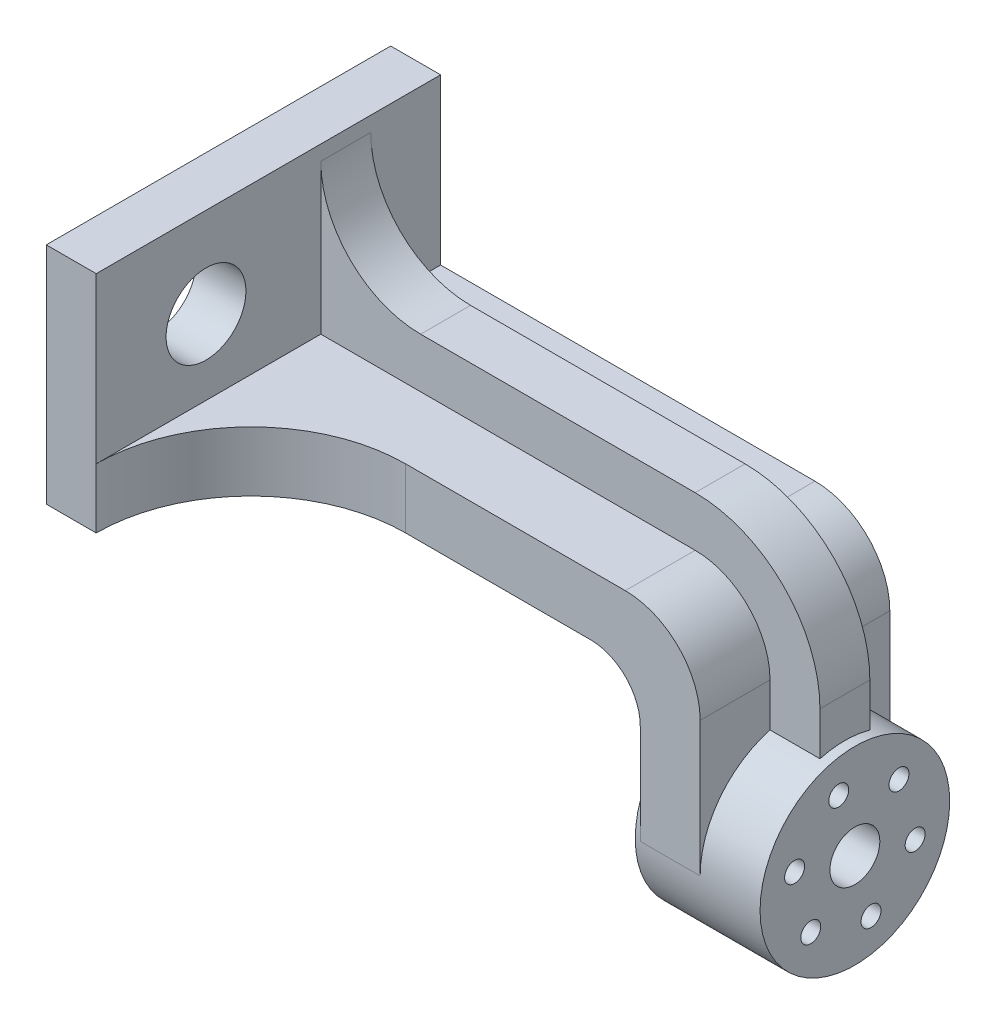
ISO-10303-21;
HEADER;
FILE_DESCRIPTION(('STEP AP214'),'2;1');
FILE_NAME('part.step','',(''),(''),'','','');
FILE_SCHEMA(('AUTOMOTIVE_DESIGN { 1 0 10303 214 1 1 1 1 }'));
ENDSEC;
DATA;
#1=APPLICATION_CONTEXT('core data for automotive mechanical design processes');
#2=APPLICATION_PROTOCOL_DEFINITION('international standard','automotive_design',2000,#1);
#3=PRODUCT_CONTEXT('',#1,'mechanical');
#4=PRODUCT('Part','Part','',(#3));
#5=PRODUCT_RELATED_PRODUCT_CATEGORY('part','',(#4));
#6=PRODUCT_DEFINITION_FORMATION('','',#4);
#7=PRODUCT_DEFINITION_CONTEXT('part definition',#1,'design');
#8=PRODUCT_DEFINITION('design','',#6,#7);
#9=PRODUCT_DEFINITION_SHAPE('','',#8);
#10=(LENGTH_UNIT() NAMED_UNIT(*) SI_UNIT(.MILLI.,.METRE.));
#11=(NAMED_UNIT(*) PLANE_ANGLE_UNIT() SI_UNIT($,.RADIAN.));
#12=(NAMED_UNIT(*) SI_UNIT($,.STERADIAN.) SOLID_ANGLE_UNIT());
#13=UNCERTAINTY_MEASURE_WITH_UNIT(LENGTH_MEASURE(1.E-05),#10,'distance_accuracy_value','');
#14=(GEOMETRIC_REPRESENTATION_CONTEXT(3) GLOBAL_UNCERTAINTY_ASSIGNED_CONTEXT((#13)) GLOBAL_UNIT_ASSIGNED_CONTEXT((#10,
#11,#12)) REPRESENTATION_CONTEXT('',''));
#15=CARTESIAN_POINT('',(0.,0.,0.));
#16=DIRECTION('',(0.,0.,1.));
#17=DIRECTION('',(1.,0.,0.));
#18=AXIS2_PLACEMENT_3D('',#15,#16,#17);
#19=CARTESIAN_POINT('',(100.,-30.,-31.));
#20=DIRECTION('',(1.,0.,0.));
#21=DIRECTION('',(0.,0.,-1.));
#22=AXIS2_PLACEMENT_3D('',#19,#20,#21);
#23=PLANE('',#22);
#24=CARTESIAN_POINT('',(100.,-30.,-50.));
#25=DIRECTION('',(1.,0.,0.));
#26=DIRECTION('',(0.,0.,-1.));
#27=AXIS2_PLACEMENT_3D('',#24,#25,#26);
#28=CIRCLE('',#27,19.);
#29=CARTESIAN_POINT('',(100.,-11.6696972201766,-45.));
#30=VERTEX_POINT('',#29);
#31=CARTESIAN_POINT('',(100.,-30.,-31.));
#32=VERTEX_POINT('',#31);
#33=EDGE_CURVE('E284',#30,#32,#28,.T.);
#34=ORIENTED_EDGE('',*,*,#33,.F.);
#35=DIRECTION('',(0.,1.,0.));
#36=VECTOR('',#35,1.);
#37=CARTESIAN_POINT('',(100.,-30.,-45.));
#38=LINE('',#37,#36);
#39=CARTESIAN_POINT('',(100.,-3.00000000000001,-45.));
#40=VERTEX_POINT('',#39);
#41=EDGE_CURVE('E215',#30,#40,#38,.T.);
#42=ORIENTED_EDGE('',*,*,#41,.T.);
#43=DIRECTION('',(0.,0.,-1.));
#44=VECTOR('',#43,1.);
#45=CARTESIAN_POINT('',(100.,-3.00000000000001,-31.));
#46=LINE('',#45,#44);
#47=CARTESIAN_POINT('',(100.,-3.00000000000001,-31.));
#48=VERTEX_POINT('',#47);
#49=EDGE_CURVE('E352',#40,#48,#46,.F.);
#50=ORIENTED_EDGE('',*,*,#49,.T.);
#51=DIRECTION('',(0.,-1.,0.));
#52=VECTOR('',#51,1.);
#53=CARTESIAN_POINT('',(100.,-30.,-31.));
#54=LINE('',#53,#52);
#55=EDGE_CURVE('E294',#48,#32,#54,.T.);
#56=ORIENTED_EDGE('',*,*,#55,.T.);
#57=EDGE_LOOP('',(#34,#42,#50,#56));
#58=FACE_BOUND('',#57,.T.);
#59=ADVANCED_FACE('F33',(#58),#23,.T.);
#60=CARTESIAN_POINT('',(100.,12.,-31.));
#61=DIRECTION('',(0.,1.,0.));
#62=DIRECTION('',(0.,0.,1.));
#63=AXIS2_PLACEMENT_3D('',#60,#61,#62);
#64=PLANE('',#63);
#65=DIRECTION('',(0.,0.,-1.));
#66=VECTOR('',#65,1.);
#67=CARTESIAN_POINT('',(85.,12.,-31.));
#68=LINE('',#67,#66);
#69=CARTESIAN_POINT('',(85.,12.,-31.));
#70=VERTEX_POINT('',#69);
#71=CARTESIAN_POINT('',(85.,12.,-45.));
#72=VERTEX_POINT('',#71);
#73=EDGE_CURVE('E355',#70,#72,#68,.T.);
#74=ORIENTED_EDGE('',*,*,#73,.T.);
#75=DIRECTION('',(-1.,0.,0.));
#76=VECTOR('',#75,1.);
#77=CARTESIAN_POINT('',(100.,12.,-45.));
#78=LINE('',#77,#76);
#79=CARTESIAN_POINT('',(10.,12.,-45.));
#80=VERTEX_POINT('',#79);
#81=EDGE_CURVE('E212',#72,#80,#78,.T.);
#82=ORIENTED_EDGE('',*,*,#81,.T.);
#83=DIRECTION('',(0.,0.,-1.));
#84=VECTOR('',#83,1.);
#85=CARTESIAN_POINT('',(10.,12.,-31.));
#86=LINE('',#85,#84);
#87=CARTESIAN_POINT('',(10.,12.,0.));
#88=VERTEX_POINT('',#87);
#89=EDGE_CURVE('E318',#88,#80,#86,.T.);
#90=ORIENTED_EDGE('',*,*,#89,.F.);
#91=CARTESIAN_POINT('',(41.,12.,0.));
#92=DIRECTION('',(0.,1.,0.));
#93=DIRECTION('',(0.,0.,1.));
#94=AXIS2_PLACEMENT_3D('',#91,#92,#93);
#95=CIRCLE('',#94,31.);
#96=CARTESIAN_POINT('',(41.,12.,-31.));
#97=VERTEX_POINT('',#96);
#98=EDGE_CURVE('E341',#88,#97,#95,.F.);
#99=ORIENTED_EDGE('',*,*,#98,.T.);
#100=DIRECTION('',(1.,0.,0.));
#101=VECTOR('',#100,1.);
#102=CARTESIAN_POINT('',(100.,12.,-31.));
#103=LINE('',#102,#101);
#104=EDGE_CURVE('E291',#97,#70,#103,.T.);
#105=ORIENTED_EDGE('',*,*,#104,.T.);
#106=EDGE_LOOP('',(#74,#82,#90,#99,#105));
#107=FACE_BOUND('',#106,.T.);
#108=ADVANCED_FACE('F461',(#107),#64,.T.);
#109=CARTESIAN_POINT('',(85.,-3.00000000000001,-31.));
#110=DIRECTION('',(0.,0.,-1.));
#111=DIRECTION('',(-1.,0.,0.));
#112=AXIS2_PLACEMENT_3D('',#109,#110,#111);
#113=CYLINDRICAL_SURFACE('',#112,15.);
#114=ORIENTED_EDGE('',*,*,#49,.F.);
#115=CARTESIAN_POINT('',(85.,-3.00000000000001,-45.));
#116=DIRECTION('',(0.,0.,-1.));
#117=DIRECTION('',(-1.,0.,0.));
#118=AXIS2_PLACEMENT_3D('',#115,#116,#117);
#119=CIRCLE('',#118,15.);
#120=EDGE_CURVE('E204',#40,#72,#119,.F.);
#121=ORIENTED_EDGE('',*,*,#120,.T.);
#122=ORIENTED_EDGE('',*,*,#73,.F.);
#123=CARTESIAN_POINT('',(85.,-3.00000000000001,-31.));
#124=DIRECTION('',(0.,0.,1.));
#125=DIRECTION('',(1.,0.,0.));
#126=AXIS2_PLACEMENT_3D('',#123,#124,#125);
#127=CIRCLE('',#126,15.);
#128=EDGE_CURVE('E361',#48,#70,#127,.T.);
#129=ORIENTED_EDGE('',*,*,#128,.F.);
#130=EDGE_LOOP('',(#114,#121,#122,#129));
#131=FACE_BOUND('',#130,.T.);
#132=ADVANCED_FACE('F459',(#131),#113,.T.);
#133=CARTESIAN_POINT('',(10.,0.,0.));
#134=DIRECTION('',(0.,0.,-1.));
#135=DIRECTION('',(-1.,0.,0.));
#136=AXIS2_PLACEMENT_3D('',#133,#134,#135);
#137=PLANE('',#136);
#138=DIRECTION('',(0.,-1.,0.));
#139=VECTOR('',#138,1.);
#140=CARTESIAN_POINT('',(0.,0.,0.));
#141=LINE('',#140,#139);
#142=CARTESIAN_POINT('',(0.,45.,0.));
#143=VERTEX_POINT('',#142);
#144=CARTESIAN_POINT('',(0.,0.,0.));
#145=VERTEX_POINT('',#144);
#146=EDGE_CURVE('E407',#143,#145,#141,.T.);
#147=ORIENTED_EDGE('',*,*,#146,.T.);
#148=DIRECTION('',(-1.,0.,0.));
#149=VECTOR('',#148,1.);
#150=CARTESIAN_POINT('',(10.,0.,0.));
#151=LINE('',#150,#149);
#152=CARTESIAN_POINT('',(10.,0.,0.));
#153=VERTEX_POINT('',#152);
#154=EDGE_CURVE('E363',#153,#145,#151,.T.);
#155=ORIENTED_EDGE('',*,*,#154,.F.);
#156=DIRECTION('',(0.,-1.,0.));
#157=VECTOR('',#156,1.);
#158=CARTESIAN_POINT('',(10.,0.,0.));
#159=LINE('',#158,#157);
#160=EDGE_CURVE('E378',#88,#153,#159,.T.);
#161=ORIENTED_EDGE('',*,*,#160,.F.);
#162=CARTESIAN_POINT('',(10.,45.,0.));
#163=VERTEX_POINT('',#162);
#164=EDGE_CURVE('E314',#163,#88,#159,.T.);
#165=ORIENTED_EDGE('',*,*,#164,.F.);
#166=DIRECTION('',(-1.,0.,0.));
#167=VECTOR('',#166,1.);
#168=CARTESIAN_POINT('',(10.,45.,0.));
#169=LINE('',#168,#167);
#170=EDGE_CURVE('E395',#163,#143,#169,.T.);
#171=ORIENTED_EDGE('',*,*,#170,.T.);
#172=EDGE_LOOP('',(#147,#155,#161,#165,#171));
#173=FACE_BOUND('',#172,.T.);
#174=ADVANCED_FACE('F417',(#173),#137,.F.);
#175=CARTESIAN_POINT('',(10.,0.,0.));
#176=DIRECTION('',(0.,1.,0.));
#177=DIRECTION('',(0.,0.,1.));
#178=AXIS2_PLACEMENT_3D('',#175,#176,#177);
#179=PLANE('',#178);
#180=DIRECTION('',(0.,0.,-1.));
#181=VECTOR('',#180,1.);
#182=CARTESIAN_POINT('',(78.,0.,0.));
#183=LINE('',#182,#181);
#184=CARTESIAN_POINT('',(78.,0.,-69.));
#185=VERTEX_POINT('',#184);
#186=CARTESIAN_POINT('',(78.,0.,-31.));
#187=VERTEX_POINT('',#186);
#188=EDGE_CURVE('E345',#185,#187,#183,.F.);
#189=ORIENTED_EDGE('',*,*,#188,.T.);
#190=DIRECTION('',(-1.,0.,0.));
#191=VECTOR('',#190,1.);
#192=CARTESIAN_POINT('',(10.,0.,-31.));
#193=LINE('',#192,#191);
#194=CARTESIAN_POINT('',(41.,0.,-31.));
#195=VERTEX_POINT('',#194);
#196=EDGE_CURVE('E304',#187,#195,#193,.T.);
#197=ORIENTED_EDGE('',*,*,#196,.T.);
#198=CARTESIAN_POINT('',(41.,0.,0.));
#199=DIRECTION('',(0.,1.,0.));
#200=DIRECTION('',(0.,0.,1.));
#201=AXIS2_PLACEMENT_3D('',#198,#199,#200);
#202=CIRCLE('',#201,31.);
#203=EDGE_CURVE('E336',#195,#153,#202,.T.);
#204=ORIENTED_EDGE('',*,*,#203,.T.);
#205=ORIENTED_EDGE('',*,*,#154,.T.);
#206=DIRECTION('',(0.,0.,-1.));
#207=VECTOR('',#206,1.);
#208=CARTESIAN_POINT('',(0.,0.,0.));
#209=LINE('',#208,#207);
#210=CARTESIAN_POINT('',(0.,0.,-69.));
#211=VERTEX_POINT('',#210);
#212=EDGE_CURVE('E391',#145,#211,#209,.T.);
#213=ORIENTED_EDGE('',*,*,#212,.T.);
#214=DIRECTION('',(-1.,0.,0.));
#215=VECTOR('',#214,1.);
#216=CARTESIAN_POINT('',(10.,0.,-69.));
#217=LINE('',#216,#215);
#218=EDGE_CURVE('E400',#185,#211,#217,.T.);
#219=ORIENTED_EDGE('',*,*,#218,.F.);
#220=EDGE_LOOP('',(#189,#197,#204,#205,#213,#219));
#221=FACE_BOUND('',#220,.T.);
#222=ADVANCED_FACE('F368',(#221),#179,.F.);
#223=CARTESIAN_POINT('',(10.,0.,-69.));
#224=DIRECTION('',(0.,0.,1.));
#225=DIRECTION('',(1.,0.,0.));
#226=AXIS2_PLACEMENT_3D('',#223,#224,#225);
#227=PLANE('',#226);
#228=DIRECTION('',(1.,0.,0.));
#229=VECTOR('',#228,1.);
#230=CARTESIAN_POINT('',(100.,12.,-69.));
#231=LINE('',#230,#229);
#232=CARTESIAN_POINT('',(10.,12.,-69.));
#233=VERTEX_POINT('',#232);
#234=CARTESIAN_POINT('',(85.,12.,-69.));
#235=VERTEX_POINT('',#234);
#236=EDGE_CURVE('E290',#233,#235,#231,.T.);
#237=ORIENTED_EDGE('',*,*,#236,.T.);
#238=CARTESIAN_POINT('',(85.,-3.00000000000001,-69.));
#239=DIRECTION('',(0.,0.,1.));
#240=DIRECTION('',(1.,0.,0.));
#241=AXIS2_PLACEMENT_3D('',#238,#239,#240);
#242=CIRCLE('',#241,15.);
#243=CARTESIAN_POINT('',(100.,-3.00000000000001,-69.));
#244=VERTEX_POINT('',#243);
#245=EDGE_CURVE('E353',#235,#244,#242,.F.);
#246=ORIENTED_EDGE('',*,*,#245,.T.);
#247=DIRECTION('',(0.,-1.,0.));
#248=VECTOR('',#247,1.);
#249=CARTESIAN_POINT('',(100.,-30.,-69.));
#250=LINE('',#249,#248);
#251=CARTESIAN_POINT('',(100.,-30.,-69.));
#252=VERTEX_POINT('',#251);
#253=EDGE_CURVE('E305',#244,#252,#250,.T.);
#254=ORIENTED_EDGE('',*,*,#253,.T.);
#255=DIRECTION('',(-1.,0.,0.));
#256=VECTOR('',#255,1.);
#257=CARTESIAN_POINT('',(88.,-30.,-69.));
#258=LINE('',#257,#256);
#259=CARTESIAN_POINT('',(88.,-30.,-69.));
#260=VERTEX_POINT('',#259);
#261=EDGE_CURVE('E307',#252,#260,#258,.T.);
#262=ORIENTED_EDGE('',*,*,#261,.T.);
#263=DIRECTION('',(0.,1.,0.));
#264=VECTOR('',#263,1.);
#265=CARTESIAN_POINT('',(88.,0.,-69.));
#266=LINE('',#265,#264);
#267=CARTESIAN_POINT('',(88.,-10.,-69.));
#268=VERTEX_POINT('',#267);
#269=EDGE_CURVE('E295',#260,#268,#266,.T.);
#270=ORIENTED_EDGE('',*,*,#269,.T.);
#271=CARTESIAN_POINT('',(78.,-10.,-69.));
#272=DIRECTION('',(0.,0.,1.));
#273=DIRECTION('',(1.,0.,0.));
#274=AXIS2_PLACEMENT_3D('',#271,#272,#273);
#275=CIRCLE('',#274,10.);
#276=EDGE_CURVE('E332',#268,#185,#275,.T.);
#277=ORIENTED_EDGE('',*,*,#276,.T.);
#278=ORIENTED_EDGE('',*,*,#218,.T.);
#279=DIRECTION('',(0.,1.,0.));
#280=VECTOR('',#279,1.);
#281=CARTESIAN_POINT('',(0.,0.,-69.));
#282=LINE('',#281,#280);
#283=CARTESIAN_POINT('',(0.,45.,-69.));
#284=VERTEX_POINT('',#283);
#285=EDGE_CURVE('E384',#211,#284,#282,.T.);
#286=ORIENTED_EDGE('',*,*,#285,.T.);
#287=DIRECTION('',(-1.,0.,0.));
#288=VECTOR('',#287,1.);
#289=CARTESIAN_POINT('',(10.,45.,-69.));
#290=LINE('',#289,#288);
#291=CARTESIAN_POINT('',(10.,45.,-69.));
#292=VERTEX_POINT('',#291);
#293=EDGE_CURVE('E397',#292,#284,#290,.T.);
#294=ORIENTED_EDGE('',*,*,#293,.F.);
#295=DIRECTION('',(0.,1.,0.));
#296=VECTOR('',#295,1.);
#297=CARTESIAN_POINT('',(10.,0.,-69.));
#298=LINE('',#297,#296);
#299=EDGE_CURVE('E383',#233,#292,#298,.T.);
#300=ORIENTED_EDGE('',*,*,#299,.F.);
#301=EDGE_LOOP('',(#237,#246,#254,#262,#270,#277,#278,#286,#294,#300));
#302=FACE_BOUND('',#301,.T.);
#303=ADVANCED_FACE('F413',(#302),#227,.F.);
#304=CARTESIAN_POINT('',(10.,45.,0.));
#305=DIRECTION('',(0.,-1.,0.));
#306=DIRECTION('',(0.,0.,-1.));
#307=AXIS2_PLACEMENT_3D('',#304,#305,#306);
#308=PLANE('',#307);
#309=DIRECTION('',(0.,0.,1.));
#310=VECTOR('',#309,1.);
#311=CARTESIAN_POINT('',(0.,45.,0.));
#312=LINE('',#311,#310);
#313=EDGE_CURVE('E382',#284,#143,#312,.T.);
#314=ORIENTED_EDGE('',*,*,#313,.T.);
#315=ORIENTED_EDGE('',*,*,#170,.F.);
#316=DIRECTION('',(0.,0.,1.));
#317=VECTOR('',#316,1.);
#318=CARTESIAN_POINT('',(10.,45.,0.));
#319=LINE('',#318,#317);
#320=EDGE_CURVE('E398',#292,#163,#319,.T.);
#321=ORIENTED_EDGE('',*,*,#320,.F.);
#322=ORIENTED_EDGE('',*,*,#293,.T.);
#323=EDGE_LOOP('',(#314,#315,#321,#322));
#324=FACE_BOUND('',#323,.T.);
#325=ADVANCED_FACE('F419',(#324),#308,.F.);
#326=CARTESIAN_POINT('',(10.,45.,0.));
#327=DIRECTION('',(-1.,0.,0.));
#328=DIRECTION('',(0.,0.,1.));
#329=AXIS2_PLACEMENT_3D('',#326,#327,#328);
#330=PLANE('',#329);
#331=CARTESIAN_POINT('',(10.,27.,-22.));
#332=DIRECTION('',(1.,0.,0.));
#333=DIRECTION('',(0.,0.,-1.));
#334=AXIS2_PLACEMENT_3D('',#331,#332,#333);
#335=CIRCLE('',#334,8.);
#336=CARTESIAN_POINT('',(10.,27.,-30.));
#337=VERTEX_POINT('',#336);
#338=EDGE_CURVE('E231',#337,#337,#335,.T.);
#339=ORIENTED_EDGE('',*,*,#338,.F.);
#340=EDGE_LOOP('',(#339));
#341=FACE_BOUND('',#340,.T.);
#342=DIRECTION('',(0.,0.,-1.));
#343=VECTOR('',#342,1.);
#344=CARTESIAN_POINT('',(10.,42.,0.));
#345=LINE('',#344,#343);
#346=CARTESIAN_POINT('',(10.,42.,-45.));
#347=VERTEX_POINT('',#346);
#348=CARTESIAN_POINT('',(10.,42.,-55.));
#349=VERTEX_POINT('',#348);
#350=EDGE_CURVE('E327',#347,#349,#345,.T.);
#351=ORIENTED_EDGE('',*,*,#350,.T.);
#352=DIRECTION('',(0.,-1.,0.));
#353=VECTOR('',#352,1.);
#354=CARTESIAN_POINT('',(10.,45.,-55.));
#355=LINE('',#354,#353);
#356=CARTESIAN_POINT('',(10.,12.,-55.));
#357=VERTEX_POINT('',#356);
#358=EDGE_CURVE('E221',#349,#357,#355,.T.);
#359=ORIENTED_EDGE('',*,*,#358,.T.);
#360=EDGE_CURVE('E322',#357,#233,#86,.T.);
#361=ORIENTED_EDGE('',*,*,#360,.T.);
#362=ORIENTED_EDGE('',*,*,#299,.T.);
#363=ORIENTED_EDGE('',*,*,#320,.T.);
#364=ORIENTED_EDGE('',*,*,#164,.T.);
#365=ORIENTED_EDGE('',*,*,#89,.T.);
#366=DIRECTION('',(0.,-1.,0.));
#367=VECTOR('',#366,1.);
#368=CARTESIAN_POINT('',(10.,45.,-45.));
#369=LINE('',#368,#367);
#370=EDGE_CURVE('E209',#347,#80,#369,.T.);
#371=ORIENTED_EDGE('',*,*,#370,.F.);
#372=EDGE_LOOP('',(#351,#359,#361,#362,#363,#364,#365,#371));
#373=FACE_BOUND('',#372,.T.);
#374=ADVANCED_FACE('F420',(#341,#373),#330,.F.);
#375=CARTESIAN_POINT('',(0.,45.,0.));
#376=DIRECTION('',(-1.,0.,0.));
#377=DIRECTION('',(0.,0.,1.));
#378=AXIS2_PLACEMENT_3D('',#375,#376,#377);
#379=PLANE('',#378);
#380=ORIENTED_EDGE('',*,*,#285,.F.);
#381=ORIENTED_EDGE('',*,*,#212,.F.);
#382=ORIENTED_EDGE('',*,*,#146,.F.);
#383=ORIENTED_EDGE('',*,*,#313,.F.);
#384=EDGE_LOOP('',(#380,#381,#382,#383));
#385=FACE_BOUND('',#384,.T.);
#386=CARTESIAN_POINT('',(0.,27.,-22.));
#387=DIRECTION('',(-1.,0.,0.));
#388=DIRECTION('',(0.,0.,1.));
#389=AXIS2_PLACEMENT_3D('',#386,#387,#388);
#390=CIRCLE('',#389,8.);
#391=CARTESIAN_POINT('',(0.,27.,-14.));
#392=VERTEX_POINT('',#391);
#393=EDGE_CURVE('E230',#392,#392,#390,.F.);
#394=ORIENTED_EDGE('',*,*,#393,.T.);
#395=EDGE_LOOP('',(#394));
#396=FACE_BOUND('',#395,.T.);
#397=ADVANCED_FACE('F415',(#385,#396),#379,.T.);
#398=CARTESIAN_POINT('',(88.,0.,-31.));
#399=DIRECTION('',(-1.,0.,0.));
#400=DIRECTION('',(0.,0.,1.));
#401=AXIS2_PLACEMENT_3D('',#398,#399,#400);
#402=PLANE('',#401);
#403=ORIENTED_EDGE('',*,*,#269,.F.);
#404=CARTESIAN_POINT('',(88.,-30.,-50.));
#405=DIRECTION('',(-1.,0.,0.));
#406=DIRECTION('',(0.,0.,1.));
#407=AXIS2_PLACEMENT_3D('',#404,#405,#406);
#408=CIRCLE('',#407,19.);
#409=CARTESIAN_POINT('',(88.,-30.,-31.));
#410=VERTEX_POINT('',#409);
#411=EDGE_CURVE('E288',#410,#260,#408,.T.);
#412=ORIENTED_EDGE('',*,*,#411,.F.);
#413=DIRECTION('',(0.,1.,0.));
#414=VECTOR('',#413,1.);
#415=CARTESIAN_POINT('',(88.,0.,-31.));
#416=LINE('',#415,#414);
#417=CARTESIAN_POINT('',(88.,-10.,-31.));
#418=VERTEX_POINT('',#417);
#419=EDGE_CURVE('E301',#410,#418,#416,.T.);
#420=ORIENTED_EDGE('',*,*,#419,.T.);
#421=DIRECTION('',(0.,0.,-1.));
#422=VECTOR('',#421,1.);
#423=CARTESIAN_POINT('',(88.,-10.,-31.));
#424=LINE('',#423,#422);
#425=EDGE_CURVE('E347',#418,#268,#424,.T.);
#426=ORIENTED_EDGE('',*,*,#425,.T.);
#427=EDGE_LOOP('',(#403,#412,#420,#426));
#428=FACE_BOUND('',#427,.T.);
#429=ADVANCED_FACE('F447',(#428),#402,.T.);
#430=DIRECTION('',(0.,1.,0.));
#431=VECTOR('',#430,1.);
#432=CARTESIAN_POINT('',(100.,-30.,-55.));
#433=LINE('',#432,#431);
#434=CARTESIAN_POINT('',(100.,-11.6696972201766,-55.));
#435=VERTEX_POINT('',#434);
#436=CARTESIAN_POINT('',(100.,-3.00000000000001,-55.));
#437=VERTEX_POINT('',#436);
#438=EDGE_CURVE('E225',#435,#437,#433,.T.);
#439=ORIENTED_EDGE('',*,*,#438,.F.);
#440=EDGE_CURVE('E285',#252,#435,#28,.T.);
#441=ORIENTED_EDGE('',*,*,#440,.F.);
#442=ORIENTED_EDGE('',*,*,#253,.F.);
#443=EDGE_CURVE('E349',#244,#437,#46,.F.);
#444=ORIENTED_EDGE('',*,*,#443,.T.);
#445=EDGE_LOOP('',(#439,#441,#442,#444));
#446=FACE_BOUND('',#445,.T.);
#447=ADVANCED_FACE('F437',(#446),#23,.T.);
#448=DIRECTION('',(-1.,0.,0.));
#449=VECTOR('',#448,1.);
#450=CARTESIAN_POINT('',(100.,12.,-55.));
#451=LINE('',#450,#449);
#452=CARTESIAN_POINT('',(85.,12.,-55.));
#453=VERTEX_POINT('',#452);
#454=EDGE_CURVE('E223',#453,#357,#451,.T.);
#455=ORIENTED_EDGE('',*,*,#454,.F.);
#456=EDGE_CURVE('E358',#453,#235,#68,.T.);
#457=ORIENTED_EDGE('',*,*,#456,.T.);
#458=ORIENTED_EDGE('',*,*,#236,.F.);
#459=ORIENTED_EDGE('',*,*,#360,.F.);
#460=EDGE_LOOP('',(#455,#457,#458,#459));
#461=FACE_BOUND('',#460,.T.);
#462=ADVANCED_FACE('F429',(#461),#64,.T.);
#463=CARTESIAN_POINT('',(10.,0.,-31.));
#464=DIRECTION('',(0.,0.,1.));
#465=DIRECTION('',(1.,0.,0.));
#466=AXIS2_PLACEMENT_3D('',#463,#464,#465);
#467=PLANE('',#466);
#468=ORIENTED_EDGE('',*,*,#104,.F.);
#469=DIRECTION('',(0.,1.,0.));
#470=VECTOR('',#469,1.);
#471=CARTESIAN_POINT('',(41.,0.,-31.));
#472=LINE('',#471,#470);
#473=EDGE_CURVE('E359',#97,#195,#472,.F.);
#474=ORIENTED_EDGE('',*,*,#473,.T.);
#475=ORIENTED_EDGE('',*,*,#196,.F.);
#476=CARTESIAN_POINT('',(78.,-10.,-31.));
#477=DIRECTION('',(0.,0.,1.));
#478=DIRECTION('',(1.,0.,0.));
#479=AXIS2_PLACEMENT_3D('',#476,#477,#478);
#480=CIRCLE('',#479,10.);
#481=EDGE_CURVE('E325',#187,#418,#480,.F.);
#482=ORIENTED_EDGE('',*,*,#481,.T.);
#483=ORIENTED_EDGE('',*,*,#419,.F.);
#484=DIRECTION('',(-1.,0.,0.));
#485=VECTOR('',#484,1.);
#486=CARTESIAN_POINT('',(88.,-30.,-31.));
#487=LINE('',#486,#485);
#488=EDGE_CURVE('E298',#32,#410,#487,.T.);
#489=ORIENTED_EDGE('',*,*,#488,.F.);
#490=ORIENTED_EDGE('',*,*,#55,.F.);
#491=ORIENTED_EDGE('',*,*,#128,.T.);
#492=EDGE_LOOP('',(#468,#474,#475,#482,#483,#489,#490,#491));
#493=FACE_BOUND('',#492,.T.);
#494=ADVANCED_FACE('F476',(#493),#467,.T.);
#495=CARTESIAN_POINT('',(87.,-30.,-50.));
#496=DIRECTION('',(1.,0.,0.));
#497=DIRECTION('',(0.,0.,-1.));
#498=AXIS2_PLACEMENT_3D('',#495,#496,#497);
#499=CYLINDRICAL_SURFACE('',#498,19.);
#500=CARTESIAN_POINT('',(87.,-30.,-50.));
#501=DIRECTION('',(1.,0.,0.));
#502=DIRECTION('',(0.,0.,-1.));
#503=AXIS2_PLACEMENT_3D('',#500,#501,#502);
#504=CIRCLE('',#503,19.);
#505=CARTESIAN_POINT('',(87.,-30.,-69.));
#506=VERTEX_POINT('',#505);
#507=EDGE_CURVE('E281',#506,#506,#504,.T.);
#508=ORIENTED_EDGE('',*,*,#507,.T.);
#509=EDGE_LOOP('',(#508));
#510=FACE_BOUND('',#509,.T.);
#511=ORIENTED_EDGE('',*,*,#411,.T.);
#512=ORIENTED_EDGE('',*,*,#261,.F.);
#513=ORIENTED_EDGE('',*,*,#440,.T.);
#514=DIRECTION('',(1.,0.,0.));
#515=VECTOR('',#514,1.);
#516=CARTESIAN_POINT('',(87.,-11.6696972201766,-55.));
#517=LINE('',#516,#515);
#518=CARTESIAN_POINT('',(110.,-11.6696972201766,-55.));
#519=VERTEX_POINT('',#518);
#520=EDGE_CURVE('E219',#519,#435,#517,.F.);
#521=ORIENTED_EDGE('',*,*,#520,.F.);
#522=CARTESIAN_POINT('',(110.,-30.,-50.));
#523=DIRECTION('',(1.,0.,0.));
#524=DIRECTION('',(0.,0.,-1.));
#525=AXIS2_PLACEMENT_3D('',#522,#523,#524);
#526=CIRCLE('',#525,19.);
#527=CARTESIAN_POINT('',(110.,-11.6696972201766,-45.));
#528=VERTEX_POINT('',#527);
#529=EDGE_CURVE('E194',#528,#519,#526,.F.);
#530=ORIENTED_EDGE('',*,*,#529,.F.);
#531=DIRECTION('',(1.,0.,0.));
#532=VECTOR('',#531,1.);
#533=CARTESIAN_POINT('',(87.,-11.6696972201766,-45.));
#534=LINE('',#533,#532);
#535=EDGE_CURVE('E205',#528,#30,#534,.F.);
#536=ORIENTED_EDGE('',*,*,#535,.T.);
#537=ORIENTED_EDGE('',*,*,#33,.T.);
#538=ORIENTED_EDGE('',*,*,#488,.T.);
#539=EDGE_LOOP('',(#511,#512,#513,#521,#530,#536,#537,#538));
#540=FACE_BOUND('',#539,.T.);
#541=CARTESIAN_POINT('',(112.,-30.,-50.));
#542=DIRECTION('',(1.,0.,0.));
#543=DIRECTION('',(0.,0.,-1.));
#544=AXIS2_PLACEMENT_3D('',#541,#542,#543);
#545=CIRCLE('',#544,19.);
#546=CARTESIAN_POINT('',(112.,-30.,-69.));
#547=VERTEX_POINT('',#546);
#548=EDGE_CURVE('E278',#547,#547,#545,.T.);
#549=ORIENTED_EDGE('',*,*,#548,.F.);
#550=EDGE_LOOP('',(#549));
#551=FACE_BOUND('',#550,.T.);
#552=ADVANCED_FACE('F442',(#510,#540,#551),#499,.T.);
#553=CARTESIAN_POINT('',(87.,-30.,-50.));
#554=DIRECTION('',(1.,0.,0.));
#555=DIRECTION('',(0.,0.,-1.));
#556=AXIS2_PLACEMENT_3D('',#553,#554,#555);
#557=PLANE('',#556);
#558=CARTESIAN_POINT('',(87.,-42.0740728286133,-53.2352380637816));
#559=DIRECTION('',(1.,0.,0.));
#560=DIRECTION('',(0.,0.,-1.));
#561=AXIS2_PLACEMENT_3D('',#558,#559,#560);
#562=CIRCLE('',#561,2.);
#563=CARTESIAN_POINT('',(87.,-42.0740728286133,-55.2352380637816));
#564=VERTEX_POINT('',#563);
#565=EDGE_CURVE('E245',#564,#564,#562,.F.);
#566=ORIENTED_EDGE('',*,*,#565,.F.);
#567=EDGE_LOOP('',(#566));
#568=FACE_BOUND('',#567,.T.);
#569=CARTESIAN_POINT('',(87.,-30.,-50.));
#570=DIRECTION('',(1.,0.,0.));
#571=DIRECTION('',(0.,0.,-1.));
#572=AXIS2_PLACEMENT_3D('',#569,#570,#571);
#573=CIRCLE('',#572,5.);
#574=CARTESIAN_POINT('',(87.,-30.,-55.));
#575=VERTEX_POINT('',#574);
#576=EDGE_CURVE('E275',#575,#575,#573,.F.);
#577=ORIENTED_EDGE('',*,*,#576,.F.);
#578=EDGE_LOOP('',(#577));
#579=FACE_BOUND('',#578,.T.);
#580=CARTESIAN_POINT('',(87.,-33.2352380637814,-62.0740728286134));
#581=DIRECTION('',(1.,0.,0.));
#582=DIRECTION('',(0.,0.,-1.));
#583=AXIS2_PLACEMENT_3D('',#580,#581,#582);
#584=CIRCLE('',#583,2.);
#585=CARTESIAN_POINT('',(87.,-33.2352380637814,-64.0740728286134));
#586=VERTEX_POINT('',#585);
#587=EDGE_CURVE('E239',#586,#586,#584,.F.);
#588=ORIENTED_EDGE('',*,*,#587,.F.);
#589=EDGE_LOOP('',(#588));
#590=FACE_BOUND('',#589,.T.);
#591=ORIENTED_EDGE('',*,*,#507,.F.);
#592=EDGE_LOOP('',(#591));
#593=FACE_BOUND('',#592,.T.);
#594=CARTESIAN_POINT('',(87.,-21.1611652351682,-58.8388347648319));
#595=DIRECTION('',(1.,0.,0.));
#596=DIRECTION('',(0.,0.,-1.));
#597=AXIS2_PLACEMENT_3D('',#594,#595,#596);
#598=CIRCLE('',#597,2.);
#599=CARTESIAN_POINT('',(87.,-21.1611652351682,-60.8388347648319));
#600=VERTEX_POINT('',#599);
#601=EDGE_CURVE('E269',#600,#600,#598,.F.);
#602=ORIENTED_EDGE('',*,*,#601,.F.);
#603=EDGE_LOOP('',(#602));
#604=FACE_BOUND('',#603,.T.);
#605=CARTESIAN_POINT('',(87.,-17.9259271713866,-46.7647619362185));
#606=DIRECTION('',(1.,0.,0.));
#607=DIRECTION('',(0.,0.,-1.));
#608=AXIS2_PLACEMENT_3D('',#605,#606,#607);
#609=CIRCLE('',#608,2.);
#610=CARTESIAN_POINT('',(87.,-17.9259271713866,-48.7647619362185));
#611=VERTEX_POINT('',#610);
#612=EDGE_CURVE('E263',#611,#611,#609,.F.);
#613=ORIENTED_EDGE('',*,*,#612,.F.);
#614=EDGE_LOOP('',(#613));
#615=FACE_BOUND('',#614,.T.);
#616=CARTESIAN_POINT('',(87.,-26.7647619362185,-37.9259271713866));
#617=DIRECTION('',(1.,0.,0.));
#618=DIRECTION('',(0.,0.,-1.));
#619=AXIS2_PLACEMENT_3D('',#616,#617,#618);
#620=CIRCLE('',#619,2.);
#621=CARTESIAN_POINT('',(87.,-26.7647619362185,-39.9259271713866));
#622=VERTEX_POINT('',#621);
#623=EDGE_CURVE('E257',#622,#622,#620,.F.);
#624=ORIENTED_EDGE('',*,*,#623,.F.);
#625=EDGE_LOOP('',(#624));
#626=FACE_BOUND('',#625,.T.);
#627=CARTESIAN_POINT('',(87.,-38.8388347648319,-41.1611652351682));
#628=DIRECTION('',(1.,0.,0.));
#629=DIRECTION('',(0.,0.,-1.));
#630=AXIS2_PLACEMENT_3D('',#627,#628,#629);
#631=CIRCLE('',#630,2.);
#632=CARTESIAN_POINT('',(87.,-38.8388347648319,-43.1611652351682));
#633=VERTEX_POINT('',#632);
#634=EDGE_CURVE('E251',#633,#633,#631,.F.);
#635=ORIENTED_EDGE('',*,*,#634,.F.);
#636=EDGE_LOOP('',(#635));
#637=FACE_BOUND('',#636,.T.);
#638=ADVANCED_FACE('F486',(#568,#579,#590,#593,#604,#615,#626,#637),#557,.F.);
#639=CARTESIAN_POINT('',(112.,-30.,-50.));
#640=DIRECTION('',(1.,0.,0.));
#641=DIRECTION('',(0.,0.,-1.));
#642=AXIS2_PLACEMENT_3D('',#639,#640,#641);
#643=PLANE('',#642);
#644=CARTESIAN_POINT('',(112.,-33.2352380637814,-62.0740728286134));
#645=DIRECTION('',(1.,0.,0.));
#646=DIRECTION('',(0.,-0.866025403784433,-0.50000000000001));
#647=AXIS2_PLACEMENT_3D('',#644,#645,#646);
#648=CIRCLE('',#647,2.);
#649=CARTESIAN_POINT('',(112.,-34.9672888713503,-63.0740728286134));
#650=VERTEX_POINT('',#649);
#651=EDGE_CURVE('E234',#650,#650,#648,.T.);
#652=ORIENTED_EDGE('',*,*,#651,.F.);
#653=EDGE_LOOP('',(#652));
#654=FACE_BOUND('',#653,.T.);
#655=CARTESIAN_POINT('',(112.,-42.0740728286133,-53.2352380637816));
#656=DIRECTION('',(1.,0.,0.));
#657=DIRECTION('',(0.,-0.866025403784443,0.499999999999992));
#658=AXIS2_PLACEMENT_3D('',#655,#656,#657);
#659=CIRCLE('',#658,2.);
#660=CARTESIAN_POINT('',(112.,-43.8061236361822,-52.2352380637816));
#661=VERTEX_POINT('',#660);
#662=EDGE_CURVE('E242',#661,#661,#659,.T.);
#663=ORIENTED_EDGE('',*,*,#662,.F.);
#664=EDGE_LOOP('',(#663));
#665=FACE_BOUND('',#664,.T.);
#666=CARTESIAN_POINT('',(112.,-38.8388347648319,-41.1611652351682));
#667=DIRECTION('',(1.,0.,0.));
#668=DIRECTION('',(0.,0.,1.));
#669=AXIS2_PLACEMENT_3D('',#666,#667,#668);
#670=CIRCLE('',#669,2.);
#671=CARTESIAN_POINT('',(112.,-38.8388347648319,-39.1611652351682));
#672=VERTEX_POINT('',#671);
#673=EDGE_CURVE('E248',#672,#672,#670,.T.);
#674=ORIENTED_EDGE('',*,*,#673,.F.);
#675=EDGE_LOOP('',(#674));
#676=FACE_BOUND('',#675,.T.);
#677=CARTESIAN_POINT('',(112.,-26.7647619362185,-37.9259271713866));
#678=DIRECTION('',(1.,0.,0.));
#679=DIRECTION('',(0.,0.866025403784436,0.500000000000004));
#680=AXIS2_PLACEMENT_3D('',#677,#678,#679);
#681=CIRCLE('',#680,2.);
#682=CARTESIAN_POINT('',(112.,-25.0327111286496,-36.9259271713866));
#683=VERTEX_POINT('',#682);
#684=EDGE_CURVE('E254',#683,#683,#681,.T.);
#685=ORIENTED_EDGE('',*,*,#684,.F.);
#686=EDGE_LOOP('',(#685));
#687=FACE_BOUND('',#686,.T.);
#688=CARTESIAN_POINT('',(112.,-17.9259271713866,-46.7647619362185));
#689=DIRECTION('',(1.,0.,0.));
#690=DIRECTION('',(0.,0.86602540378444,-0.499999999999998));
#691=AXIS2_PLACEMENT_3D('',#688,#689,#690);
#692=CIRCLE('',#691,2.);
#693=CARTESIAN_POINT('',(112.,-16.1938763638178,-47.7647619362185));
#694=VERTEX_POINT('',#693);
#695=EDGE_CURVE('E260',#694,#694,#692,.T.);
#696=ORIENTED_EDGE('',*,*,#695,.F.);
#697=EDGE_LOOP('',(#696));
#698=FACE_BOUND('',#697,.T.);
#699=CARTESIAN_POINT('',(112.,-21.1611652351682,-58.8388347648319));
#700=DIRECTION('',(1.,0.,0.));
#701=DIRECTION('',(0.,0.,-1.));
#702=AXIS2_PLACEMENT_3D('',#699,#700,#701);
#703=CIRCLE('',#702,2.);
#704=CARTESIAN_POINT('',(112.,-21.1611652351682,-60.8388347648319));
#705=VERTEX_POINT('',#704);
#706=EDGE_CURVE('E266',#705,#705,#703,.T.);
#707=ORIENTED_EDGE('',*,*,#706,.F.);
#708=EDGE_LOOP('',(#707));
#709=FACE_BOUND('',#708,.T.);
#710=CARTESIAN_POINT('',(112.,-30.,-50.));
#711=DIRECTION('',(1.,0.,0.));
#712=DIRECTION('',(0.,0.,-1.));
#713=AXIS2_PLACEMENT_3D('',#710,#711,#712);
#714=CIRCLE('',#713,5.);
#715=CARTESIAN_POINT('',(112.,-30.,-55.));
#716=VERTEX_POINT('',#715);
#717=EDGE_CURVE('E272',#716,#716,#714,.T.);
#718=ORIENTED_EDGE('',*,*,#717,.F.);
#719=EDGE_LOOP('',(#718));
#720=FACE_BOUND('',#719,.T.);
#721=ORIENTED_EDGE('',*,*,#548,.T.);
#722=EDGE_LOOP('',(#721));
#723=FACE_BOUND('',#722,.T.);
#724=ADVANCED_FACE('F490',(#654,#665,#676,#687,#698,#709,#720,#723),#643,.T.);
#725=CARTESIAN_POINT('',(-0.001000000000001,-30.,-50.));
#726=DIRECTION('',(1.,0.,0.));
#727=DIRECTION('',(0.,0.,-1.));
#728=AXIS2_PLACEMENT_3D('',#725,#726,#727);
#729=CYLINDRICAL_SURFACE('',#728,5.);
#730=ORIENTED_EDGE('',*,*,#717,.T.);
#731=EDGE_LOOP('',(#730));
#732=FACE_BOUND('',#731,.T.);
#733=ORIENTED_EDGE('',*,*,#576,.T.);
#734=EDGE_LOOP('',(#733));
#735=FACE_BOUND('',#734,.T.);
#736=ADVANCED_FACE('F494',(#732,#735),#729,.F.);
#737=CARTESIAN_POINT('',(-0.001000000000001,-21.1611652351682,-58.8388347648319));
#738=DIRECTION('',(1.,0.,0.));
#739=DIRECTION('',(0.,0.,-1.));
#740=AXIS2_PLACEMENT_3D('',#737,#738,#739);
#741=CYLINDRICAL_SURFACE('',#740,2.);
#742=ORIENTED_EDGE('',*,*,#706,.T.);
#743=EDGE_LOOP('',(#742));
#744=FACE_BOUND('',#743,.T.);
#745=ORIENTED_EDGE('',*,*,#601,.T.);
#746=EDGE_LOOP('',(#745));
#747=FACE_BOUND('',#746,.T.);
#748=ADVANCED_FACE('F498',(#744,#747),#741,.F.);
#749=CARTESIAN_POINT('',(-0.001000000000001,-17.9259271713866,-46.7647619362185));
#750=DIRECTION('',(1.,0.,0.));
#751=DIRECTION('',(0.,0.,-1.));
#752=AXIS2_PLACEMENT_3D('',#749,#750,#751);
#753=CYLINDRICAL_SURFACE('',#752,2.);
#754=ORIENTED_EDGE('',*,*,#612,.T.);
#755=EDGE_LOOP('',(#754));
#756=FACE_BOUND('',#755,.T.);
#757=ORIENTED_EDGE('',*,*,#695,.T.);
#758=EDGE_LOOP('',(#757));
#759=FACE_BOUND('',#758,.T.);
#760=ADVANCED_FACE('F502',(#756,#759),#753,.F.);
#761=CARTESIAN_POINT('',(-0.001000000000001,-26.7647619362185,-37.9259271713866));
#762=DIRECTION('',(1.,0.,0.));
#763=DIRECTION('',(0.,0.,-1.));
#764=AXIS2_PLACEMENT_3D('',#761,#762,#763);
#765=CYLINDRICAL_SURFACE('',#764,2.);
#766=ORIENTED_EDGE('',*,*,#684,.T.);
#767=EDGE_LOOP('',(#766));
#768=FACE_BOUND('',#767,.T.);
#769=ORIENTED_EDGE('',*,*,#623,.T.);
#770=EDGE_LOOP('',(#769));
#771=FACE_BOUND('',#770,.T.);
#772=ADVANCED_FACE('F506',(#768,#771),#765,.F.);
#773=CARTESIAN_POINT('',(-0.001000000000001,-38.8388347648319,-41.1611652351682));
#774=DIRECTION('',(1.,0.,0.));
#775=DIRECTION('',(0.,0.,-1.));
#776=AXIS2_PLACEMENT_3D('',#773,#774,#775);
#777=CYLINDRICAL_SURFACE('',#776,2.);
#778=ORIENTED_EDGE('',*,*,#673,.T.);
#779=EDGE_LOOP('',(#778));
#780=FACE_BOUND('',#779,.T.);
#781=ORIENTED_EDGE('',*,*,#634,.T.);
#782=EDGE_LOOP('',(#781));
#783=FACE_BOUND('',#782,.T.);
#784=ADVANCED_FACE('F510',(#780,#783),#777,.F.);
#785=CARTESIAN_POINT('',(-0.001000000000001,-42.0740728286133,-53.2352380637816));
#786=DIRECTION('',(1.,0.,0.));
#787=DIRECTION('',(0.,0.,-1.));
#788=AXIS2_PLACEMENT_3D('',#785,#786,#787);
#789=CYLINDRICAL_SURFACE('',#788,2.);
#790=ORIENTED_EDGE('',*,*,#565,.T.);
#791=EDGE_LOOP('',(#790));
#792=FACE_BOUND('',#791,.T.);
#793=ORIENTED_EDGE('',*,*,#662,.T.);
#794=EDGE_LOOP('',(#793));
#795=FACE_BOUND('',#794,.T.);
#796=ADVANCED_FACE('F514',(#792,#795),#789,.F.);
#797=CARTESIAN_POINT('',(-0.001000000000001,-33.2352380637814,-62.0740728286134));
#798=DIRECTION('',(1.,0.,0.));
#799=DIRECTION('',(0.,0.,-1.));
#800=AXIS2_PLACEMENT_3D('',#797,#798,#799);
#801=CYLINDRICAL_SURFACE('',#800,2.);
#802=ORIENTED_EDGE('',*,*,#651,.T.);
#803=EDGE_LOOP('',(#802));
#804=FACE_BOUND('',#803,.T.);
#805=ORIENTED_EDGE('',*,*,#587,.T.);
#806=EDGE_LOOP('',(#805));
#807=FACE_BOUND('',#806,.T.);
#808=ADVANCED_FACE('F518',(#804,#807),#801,.F.);
#809=CARTESIAN_POINT('',(-0.000999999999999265,27.,-22.));
#810=DIRECTION('',(1.,0.,0.));
#811=DIRECTION('',(0.,0.,-1.));
#812=AXIS2_PLACEMENT_3D('',#809,#810,#811);
#813=CYLINDRICAL_SURFACE('',#812,8.);
#814=ORIENTED_EDGE('',*,*,#393,.F.);
#815=EDGE_LOOP('',(#814));
#816=FACE_BOUND('',#815,.T.);
#817=ORIENTED_EDGE('',*,*,#338,.T.);
#818=EDGE_LOOP('',(#817));
#819=FACE_BOUND('',#818,.T.);
#820=ADVANCED_FACE('F522',(#816,#819),#813,.F.);
#821=CARTESIAN_POINT('',(41.,45.,0.));
#822=DIRECTION('',(0.,1.,0.));
#823=DIRECTION('',(0.,0.,1.));
#824=AXIS2_PLACEMENT_3D('',#821,#822,#823);
#825=CYLINDRICAL_SURFACE('',#824,31.);
#826=ORIENTED_EDGE('',*,*,#203,.F.);
#827=ORIENTED_EDGE('',*,*,#473,.F.);
#828=ORIENTED_EDGE('',*,*,#98,.F.);
#829=ORIENTED_EDGE('',*,*,#160,.T.);
#830=EDGE_LOOP('',(#826,#827,#828,#829));
#831=FACE_BOUND('',#830,.T.);
#832=ADVANCED_FACE('F375',(#831),#825,.F.);
#833=CARTESIAN_POINT('',(85.,-3.00000000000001,-55.));
#834=DIRECTION('',(0.,0.,-1.));
#835=DIRECTION('',(-1.,0.,0.));
#836=AXIS2_PLACEMENT_3D('',#833,#834,#835);
#837=CIRCLE('',#836,15.);
#838=EDGE_CURVE('E208',#437,#453,#837,.F.);
#839=ORIENTED_EDGE('',*,*,#838,.F.);
#840=ORIENTED_EDGE('',*,*,#443,.F.);
#841=ORIENTED_EDGE('',*,*,#245,.F.);
#842=ORIENTED_EDGE('',*,*,#456,.F.);
#843=EDGE_LOOP('',(#839,#840,#841,#842));
#844=FACE_BOUND('',#843,.T.);
#845=ADVANCED_FACE('F434',(#844),#113,.T.);
#846=CARTESIAN_POINT('',(78.,-10.,-31.));
#847=DIRECTION('',(0.,0.,-1.));
#848=DIRECTION('',(-1.,0.,0.));
#849=AXIS2_PLACEMENT_3D('',#846,#847,#848);
#850=CYLINDRICAL_SURFACE('',#849,10.);
#851=ORIENTED_EDGE('',*,*,#276,.F.);
#852=ORIENTED_EDGE('',*,*,#425,.F.);
#853=ORIENTED_EDGE('',*,*,#481,.F.);
#854=ORIENTED_EDGE('',*,*,#188,.F.);
#855=EDGE_LOOP('',(#851,#852,#853,#854));
#856=FACE_BOUND('',#855,.T.);
#857=ADVANCED_FACE('F450',(#856),#850,.F.);
#858=CARTESIAN_POINT('',(85.,22.,-50.));
#859=DIRECTION('',(0.,1.,0.));
#860=DIRECTION('',(1.,0.,0.));
#861=AXIS2_PLACEMENT_3D('',#858,#859,#860);
#862=PLANE('',#861);
#863=DIRECTION('',(-1.,0.,0.));
#864=VECTOR('',#863,1.);
#865=CARTESIAN_POINT('',(56.,22.,-55.));
#866=LINE('',#865,#864);
#867=CARTESIAN_POINT('',(30.,22.,-55.));
#868=VERTEX_POINT('',#867);
#869=CARTESIAN_POINT('',(85.,22.,-55.));
#870=VERTEX_POINT('',#869);
#871=EDGE_CURVE('E184',#868,#870,#866,.F.);
#872=ORIENTED_EDGE('',*,*,#871,.F.);
#873=DIRECTION('',(0.,0.,-1.));
#874=VECTOR('',#873,1.);
#875=CARTESIAN_POINT('',(30.,22.,-50.));
#876=LINE('',#875,#874);
#877=CARTESIAN_POINT('',(30.,22.,-45.));
#878=VERTEX_POINT('',#877);
#879=EDGE_CURVE('E54',#868,#878,#876,.F.);
#880=ORIENTED_EDGE('',*,*,#879,.T.);
#881=DIRECTION('',(-1.,0.,0.));
#882=VECTOR('',#881,1.);
#883=CARTESIAN_POINT('',(56.,22.,-45.));
#884=LINE('',#883,#882);
#885=CARTESIAN_POINT('',(85.,22.,-45.));
#886=VERTEX_POINT('',#885);
#887=EDGE_CURVE('E195',#878,#886,#884,.F.);
#888=ORIENTED_EDGE('',*,*,#887,.T.);
#889=DIRECTION('',(0.,0.,-1.));
#890=VECTOR('',#889,1.);
#891=CARTESIAN_POINT('',(85.,22.,-50.));
#892=LINE('',#891,#890);
#893=EDGE_CURVE('E183',#886,#870,#892,.T.);
#894=ORIENTED_EDGE('',*,*,#893,.T.);
#895=EDGE_LOOP('',(#872,#880,#888,#894));
#896=FACE_BOUND('',#895,.T.);
#897=ADVANCED_FACE('F452',(#896),#862,.T.);
#898=CARTESIAN_POINT('',(85.,-3.00000000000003,-50.));
#899=DIRECTION('',(0.,0.,-1.));
#900=DIRECTION('',(-1.,0.,0.));
#901=AXIS2_PLACEMENT_3D('',#898,#899,#900);
#902=CYLINDRICAL_SURFACE('',#901,25.);
#903=ORIENTED_EDGE('',*,*,#893,.F.);
#904=CARTESIAN_POINT('',(85.,-3.00000000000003,-45.));
#905=DIRECTION('',(0.,0.,-1.));
#906=DIRECTION('',(-1.,0.,0.));
#907=AXIS2_PLACEMENT_3D('',#904,#905,#906);
#908=CIRCLE('',#907,25.);
#909=CARTESIAN_POINT('',(110.,-3.00000000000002,-45.));
#910=VERTEX_POINT('',#909);
#911=EDGE_CURVE('E178',#886,#910,#908,.T.);
#912=ORIENTED_EDGE('',*,*,#911,.T.);
#913=DIRECTION('',(0.,0.,-1.));
#914=VECTOR('',#913,1.);
#915=CARTESIAN_POINT('',(110.,-3.00000000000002,-50.));
#916=LINE('',#915,#914);
#917=CARTESIAN_POINT('',(110.,-3.00000000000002,-55.));
#918=VERTEX_POINT('',#917);
#919=EDGE_CURVE('E172',#910,#918,#916,.T.);
#920=ORIENTED_EDGE('',*,*,#919,.T.);
#921=CARTESIAN_POINT('',(85.,-3.00000000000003,-55.));
#922=DIRECTION('',(0.,0.,-1.));
#923=DIRECTION('',(-1.,0.,0.));
#924=AXIS2_PLACEMENT_3D('',#921,#922,#923);
#925=CIRCLE('',#924,25.);
#926=EDGE_CURVE('E176',#870,#918,#925,.T.);
#927=ORIENTED_EDGE('',*,*,#926,.F.);
#928=EDGE_LOOP('',(#903,#912,#920,#927));
#929=FACE_BOUND('',#928,.T.);
#930=ADVANCED_FACE('F175',(#929),#902,.T.);
#931=CARTESIAN_POINT('',(110.,-3.00000000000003,-50.));
#932=DIRECTION('',(1.,0.,0.));
#933=DIRECTION('',(0.,-1.,0.));
#934=AXIS2_PLACEMENT_3D('',#931,#932,#933);
#935=PLANE('',#934);
#936=DIRECTION('',(0.,1.,0.));
#937=VECTOR('',#936,1.);
#938=CARTESIAN_POINT('',(110.,-1.9999875,-45.));
#939=LINE('',#938,#937);
#940=EDGE_CURVE('E200',#910,#528,#939,.F.);
#941=ORIENTED_EDGE('',*,*,#940,.T.);
#942=ORIENTED_EDGE('',*,*,#529,.T.);
#943=DIRECTION('',(0.,1.,0.));
#944=VECTOR('',#943,1.);
#945=CARTESIAN_POINT('',(110.,-1.9999875,-55.));
#946=LINE('',#945,#944);
#947=EDGE_CURVE('E188',#918,#519,#946,.F.);
#948=ORIENTED_EDGE('',*,*,#947,.F.);
#949=ORIENTED_EDGE('',*,*,#919,.F.);
#950=EDGE_LOOP('',(#941,#942,#948,#949));
#951=FACE_BOUND('',#950,.T.);
#952=ADVANCED_FACE('F192',(#951),#935,.T.);
#953=CARTESIAN_POINT('',(56.,-1.9999875,-55.));
#954=DIRECTION('',(0.,0.,-1.));
#955=DIRECTION('',(-1.,0.,0.));
#956=AXIS2_PLACEMENT_3D('',#953,#954,#955);
#957=PLANE('',#956);
#958=ORIENTED_EDGE('',*,*,#947,.T.);
#959=ORIENTED_EDGE('',*,*,#520,.T.);
#960=ORIENTED_EDGE('',*,*,#438,.T.);
#961=ORIENTED_EDGE('',*,*,#838,.T.);
#962=ORIENTED_EDGE('',*,*,#454,.T.);
#963=ORIENTED_EDGE('',*,*,#358,.F.);
#964=CARTESIAN_POINT('',(30.,42.,-55.));
#965=DIRECTION('',(0.,0.,-1.));
#966=DIRECTION('',(-1.,0.,0.));
#967=AXIS2_PLACEMENT_3D('',#964,#965,#966);
#968=CIRCLE('',#967,20.);
#969=EDGE_CURVE('E41',#349,#868,#968,.F.);
#970=ORIENTED_EDGE('',*,*,#969,.T.);
#971=ORIENTED_EDGE('',*,*,#871,.T.);
#972=ORIENTED_EDGE('',*,*,#926,.T.);
#973=EDGE_LOOP('',(#958,#959,#960,#961,#962,#963,#970,#971,#972));
#974=FACE_BOUND('',#973,.T.);
#975=ADVANCED_FACE('F187',(#974),#957,.T.);
#976=CARTESIAN_POINT('',(56.,-1.9999875,-45.));
#977=DIRECTION('',(0.,0.,-1.));
#978=DIRECTION('',(-1.,0.,0.));
#979=AXIS2_PLACEMENT_3D('',#976,#977,#978);
#980=PLANE('',#979);
#981=ORIENTED_EDGE('',*,*,#535,.F.);
#982=ORIENTED_EDGE('',*,*,#940,.F.);
#983=ORIENTED_EDGE('',*,*,#911,.F.);
#984=ORIENTED_EDGE('',*,*,#887,.F.);
#985=CARTESIAN_POINT('',(30.,42.,-45.));
#986=DIRECTION('',(0.,0.,-1.));
#987=DIRECTION('',(-1.,0.,0.));
#988=AXIS2_PLACEMENT_3D('',#985,#986,#987);
#989=CIRCLE('',#988,20.);
#990=EDGE_CURVE('E12',#878,#347,#989,.T.);
#991=ORIENTED_EDGE('',*,*,#990,.T.);
#992=ORIENTED_EDGE('',*,*,#370,.T.);
#993=ORIENTED_EDGE('',*,*,#81,.F.);
#994=ORIENTED_EDGE('',*,*,#120,.F.);
#995=ORIENTED_EDGE('',*,*,#41,.F.);
#996=EDGE_LOOP('',(#981,#982,#983,#984,#991,#992,#993,#994,#995));
#997=FACE_BOUND('',#996,.T.);
#998=ADVANCED_FACE('F531',(#997),#980,.F.);
#999=CARTESIAN_POINT('',(30.,42.,0.));
#1000=DIRECTION('',(0.,0.,-1.));
#1001=DIRECTION('',(-1.,0.,0.));
#1002=AXIS2_PLACEMENT_3D('',#999,#1000,#1001);
#1003=CYLINDRICAL_SURFACE('',#1002,20.);
#1004=ORIENTED_EDGE('',*,*,#990,.F.);
#1005=ORIENTED_EDGE('',*,*,#879,.F.);
#1006=ORIENTED_EDGE('',*,*,#969,.F.);
#1007=ORIENTED_EDGE('',*,*,#350,.F.);
#1008=EDGE_LOOP('',(#1004,#1005,#1006,#1007));
#1009=FACE_BOUND('',#1008,.T.);
#1010=ADVANCED_FACE('F35',(#1009),#1003,.F.);
#1011=CLOSED_SHELL('',(#59,#108,#132,#174,#222,#303,#325,#374,#397,#429,#447,#462,#494,#552,
#638,#724,#736,#748,#760,#772,#784,#796,#808,#820,#832,#845,#857,#897,#930,#952,#975,#998,#1010));
#1012=MANIFOLD_SOLID_BREP('B2',#1011);
#1013=ADVANCED_BREP_SHAPE_REPRESENTATION('',(#18,#1012),#14);
#1014=SHAPE_DEFINITION_REPRESENTATION(#9,#1013);
ENDSEC;
END-ISO-10303-21;
